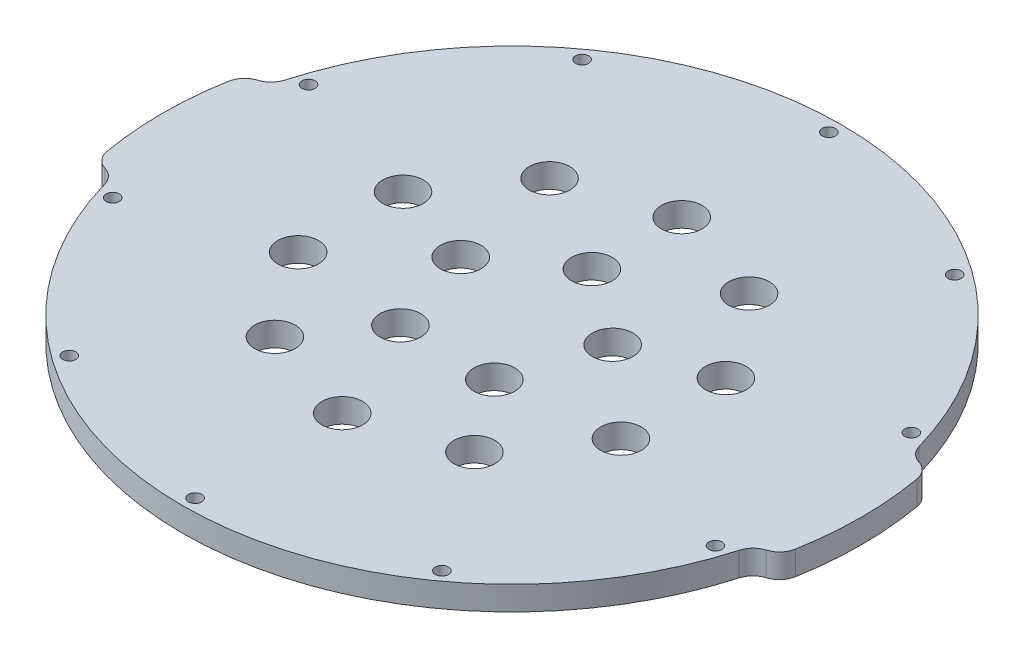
from build123d import *

# Parameters (mm, degrees)
SKETCH1_R           = 1.65
BOSS_EXTRUDE1_DEPTH = 6
FILLET1_R           = 5
SKETCH2_R           = 5.1
CUT_EXTRUDE1_DEPTH  = 121.480309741


with BuildPart() as part:
    # Sketch1 → Boss-Extrude1 (new body)
    with BuildSketch(Plane(origin=(0, 0, 0), x_dir=(1, 0, 0), z_dir=(0, 1, 0))):
        with BuildLine():
            ThreePointArc((-86.219918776, -15.202897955), (-87.55, 0), (-86.219918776, 15.202897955))
            ThreePointArc((-86.219918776, 15.202897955), (-84.101406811, 18.473379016), (-80.278914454, 19.23014285))
            ThreePointArc((-80.278914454, 19.23014285), (0, 82.55), (80.278914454, 19.23014285))
            ThreePointArc((80.278914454, 19.23014285), (84.101406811, 18.473379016), (86.219918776, 15.202897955))
            ThreePointArc((86.219918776, 15.202897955), (87.55, 0), (86.219918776, -15.202897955))
            ThreePointArc((86.219918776, -15.202897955), (84.101406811, -18.473379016), (80.278914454, -19.23014285))
            ThreePointArc((80.278914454, -19.23014285), (0, -82.55), (-80.278914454, -19.23014285))
            ThreePointArc((-80.278914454, -19.23014285), (-84.101406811, -18.473379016), (-86.219918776, -15.202897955))
        make_face()
        with Locations(Location((0, 79.35, 0), (0, 0, 270))):
            Circle(SKETCH1_R, mode=Mode.SUBTRACT)
        with Locations(Location((46.640759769, 64.195498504, 0), (0, 0, 270))):
            Circle(SKETCH1_R, mode=Mode.SUBTRACT)
        with Locations(Location((75.466334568, 24.520498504, 0), (0, 0, 270))):
            Circle(SKETCH1_R, mode=Mode.SUBTRACT)
        with Locations(Location((75.466334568, -24.520498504, 0), (0, 0, 270))):
            Circle(SKETCH1_R, mode=Mode.SUBTRACT)
        with Locations(Location((46.640759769, -64.195498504, 0), (0, 0, 270))):
            Circle(SKETCH1_R, mode=Mode.SUBTRACT)
        with Locations(Location((0, -79.35, 0), (0, 0, 270))):
            Circle(SKETCH1_R, mode=Mode.SUBTRACT)
        with Locations(Location((-46.640759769, -64.195498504, 0), (0, 0, 270))):
            Circle(SKETCH1_R, mode=Mode.SUBTRACT)
        with Locations(Location((-75.466334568, -24.520498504, 0), (0, 0, 270))):
            Circle(SKETCH1_R, mode=Mode.SUBTRACT)
        with Locations(Location((-75.466334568, 24.520498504, 0), (0, 0, 270))):
            Circle(SKETCH1_R, mode=Mode.SUBTRACT)
        with Locations(Location((-46.640759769, 64.195498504, 0), (0, 0, 270))):
            Circle(SKETCH1_R, mode=Mode.SUBTRACT)
    extrude(amount=BOSS_EXTRUDE1_DEPTH)

    # Fillet1
    fillet1_edges = [part.edges().sort_by_distance(p)[0] for p in [
        (-80.278914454, 3, -19.23014285),
        (80.278914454, 3, -19.23014285),
        (80.278914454, 3, 19.23014285),
        (-80.278914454, 3, 19.23014285),
    ]]
    fillet(fillet1_edges, radius=FILLET1_R)

    # Sketch2 → Cut-Extrude1 (cut, through all)
    with BuildSketch(Plane(origin=(0, 6, 0), x_dir=(1, 0, 0), z_dir=(0, 1, 0))):
        with Locations(Location((0, 42.5, 0), (0, 0, 270))):
            Circle(SKETCH2_R)
        with Locations(Location((24.980873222, 34.383222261, 0), (0, 0, 270))):
            Circle(SKETCH2_R)
        with Locations(Location((40.419901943, 13.133222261, 0), (0, 0, 270))):
            Circle(SKETCH2_R)
        with Locations(Location((40.419901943, -13.133222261, 0), (0, 0, 270))):
            Circle(SKETCH2_R)
        with Locations(Location((24.980873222, -34.383222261, 0), (0, 0, 270))):
            Circle(SKETCH2_R)
        with Locations(Location((0, -42.5, 0), (0, 0, 270))):
            Circle(SKETCH2_R)
        with Locations(Location((-24.980873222, -34.383222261, 0), (0, 0, 270))):
            Circle(SKETCH2_R)
        with Locations(Location((-40.419901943, -13.133222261, 0), (0, 0, 270))):
            Circle(SKETCH2_R)
        with Locations(Location((-40.419901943, 13.133222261, 0), (0, 0, 270))):
            Circle(SKETCH2_R)
        with Locations(Location((-24.980873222, 34.383222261, 0), (0, 0, 270))):
            Circle(SKETCH2_R)
        with Locations(Location((11.755705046, -16.180339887, 0), (0, 0, 270))):
            Circle(SKETCH2_R)
        with Locations(Location((-11.755705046, -16.180339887, 0), (0, 0, 270))):
            Circle(SKETCH2_R)
        with Locations(Location((-19.021130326, 6.180339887, 0), (0, 0, 270))):
            Circle(SKETCH2_R)
        with Locations(Location((0, 20, 0), (0, 0, 270))):
            Circle(SKETCH2_R)
        with Locations(Location((19.021130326, 6.180339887, 0), (0, 0, 270))):
            Circle(SKETCH2_R)
    extrude(amount=-CUT_EXTRUDE1_DEPTH, mode=Mode.SUBTRACT)


solid = part.part
